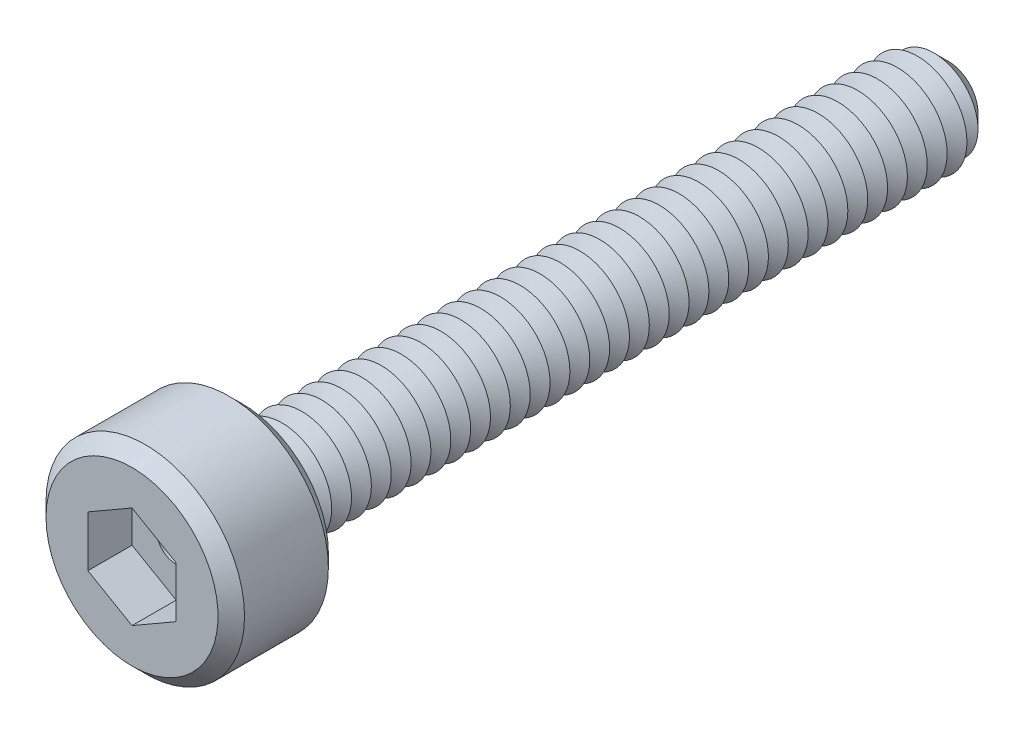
from build123d import *

# Parameters (mm, degrees)
SKETCH1_R           = 2.25
BOSS_EXTRUDE1_DEPTH = 2.5
SKETCH2_R           = 1.125
BOSS_EXTRUDE2_DEPTH = 16
CHAMFER1_SIZE       = 0.45
LPATTERN1_COUNT     = 35
LPATTERN1_PITCH     = 0.45
CUT_EXTRUDE1_DEPTH  = 1
SKETCH6_R           = 0.45
CUT_EXTRUDE2_DEPTH  = 17.5
CHAMFER2_SIZE       = 0.3


with BuildPart() as part:
    # Sketch1 → Boss-Extrude1 (new body)
    with BuildSketch(Plane.XY):
        Circle(SKETCH1_R)
    extrude(amount=BOSS_EXTRUDE1_DEPTH)

    # Sketch2 → Boss-Extrude2 (add)
    with BuildSketch(Plane(origin=(0, 0, 0), x_dir=(-1, 0, 0), z_dir=(0, 0, -1))):
        Circle(SKETCH2_R)
    extrude(amount=BOSS_EXTRUDE2_DEPTH)

    # Chamfer1
    chamfer1_edges = [part.edges().sort_by_distance(p)[0] for p in [
        (1.125, 0, -16),
    ]]
    chamfer(chamfer1_edges, length=CHAMFER1_SIZE)

    # Sketch4 → Cut-Revolve1 (revolve, cut)
    with BuildSketch(Plane(origin=(0, 0, 0), x_dir=(0, 0, -1), z_dir=(1, 0, 0)), mode=Mode.PRIVATE) as cut_revolve1_sk:
        Polygon((0, 1.125), (0.225, 0.735288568), (0.45, 1.125), align=None)
    cut_revolve1 = revolve(cut_revolve1_sk.sketch.rotate(Axis((0, 0, 2.512122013), (0, 0, -1)), 90), axis=Axis((0, 0, 2.512122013), (0, 0, -1)), mode=Mode.SUBTRACT)

    # LPattern1: Cut-Revolve1 ×35
    with Locations(*[(0, 0, -i * LPATTERN1_PITCH) for i in range(1, LPATTERN1_COUNT)]):
        add(cut_revolve1, mode=Mode.SUBTRACT)

    # Sketch5 → Cut-Extrude1 (cut)
    with BuildSketch(Plane.XY.offset(2.5)):
        Polygon((0, 1.154700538), (-1, 0.577350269), (-1, -0.577350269), (0, -1.154700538), (1, -0.577350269), (1, 0.577350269), align=None)
    extrude(amount=-CUT_EXTRUDE1_DEPTH, mode=Mode.SUBTRACT)

    # Sketch6 → Cut-Extrude2 (cut)
    with BuildSketch(Plane.XY.offset(1.5)):
        Circle(SKETCH6_R)
    extrude(amount=-CUT_EXTRUDE2_DEPTH, mode=Mode.SUBTRACT)

    # Chamfer2
    chamfer2_edges = [part.edges().sort_by_distance(p)[0] for p in [
        (-2.25, 0, 0),
        (-2.25, 0, 2.5),
    ]]
    chamfer(chamfer2_edges, length=CHAMFER2_SIZE)


solid = part.part
